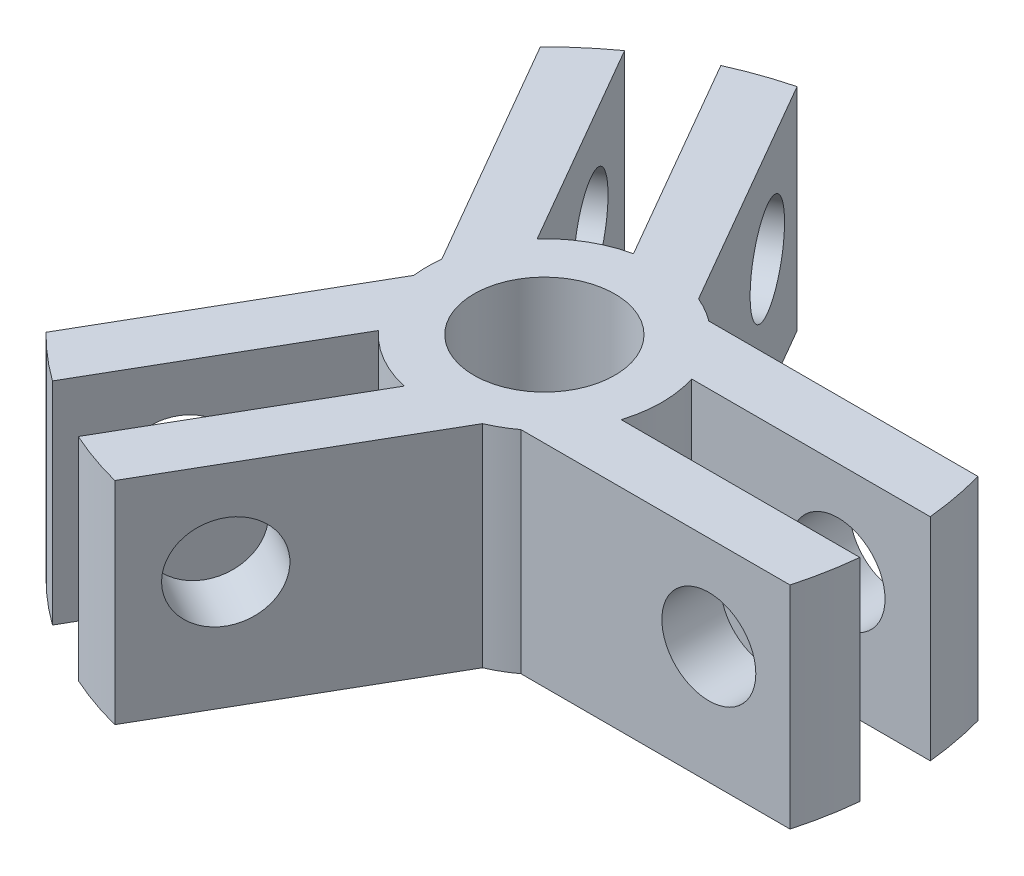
from build123d import *

# Parameters (mm, degrees)
SKETCH1_R          = 30
EXTRUDE1_DEPTH     = 18
M12_TAPPED_HOLE1_D = 12
CUT_EXTRUDE4_DEPTH = 47.086874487
CIRPATTERN11_COUNT = 3
CUT_EXTRUDE5_DEPTH = 47.086874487
CIRPATTERN12_COUNT = 3
SKETCH24_R         = 4
CUT_EXTRUDE6_DEPTH = 46.368708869
CIRPATTERN13_COUNT = 3


with BuildPart() as part:
    # Sketch1 → Extrude1 (new body)
    with BuildSketch(Plane(origin=(0, 0, 0), x_dir=(1, 0, 0), z_dir=(0, 1, 0))):
        with Locations(Location((0, 0, 0), (0, 0, 270))):
            Circle(SKETCH1_R)
    extrude(amount=EXTRUDE1_DEPTH)

    # M12 Tapped Hole1 (through all)
    with Locations(Plane(origin=(0, 18, 0), x_dir=(-1, 0, 0), z_dir=(0, 1, 0))):
        with Locations((0, 0)):
            Hole(M12_TAPPED_HOLE1_D / 2)

    # Sketch2 → Cut-Extrude4 (cut, through all)
    with BuildSketch(Plane(origin=(0, 18, 0), x_dir=(-1, 0, 0), z_dir=(0, 1, 0))):
        with BuildLine():
            Line((-29.849623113, -3), (-9.539392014, -3))
            ThreePointArc((-9.539392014, -3), (-10, 0), (-9.539392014, 3))
            Line((-9.539392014, 3), (-29.849623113, 3))
            ThreePointArc((-29.849623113, 3), (-30, 0), (-29.849623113, -3))
        make_face()
    cut_extrude4 = extrude(amount=-CUT_EXTRUDE4_DEPTH, mode=Mode.SUBTRACT)

    # CirPattern11: Cut-Extrude4 ×3 about axis
    cirpattern11_axis = Axis((0, 0, 0), (0, 1, 0))
    for i in range(1, CIRPATTERN11_COUNT):
        add(cut_extrude4.rotate(cirpattern11_axis, i * 360 / CIRPATTERN11_COUNT), mode=Mode.SUBTRACT)

    # Sketch23 → Cut-Extrude5 (cut, through all)
    with BuildSketch(Plane(origin=(0, 18, 0), x_dir=(-1, 0, 0), z_dir=(0, 1, 0))):
        with BuildLine():
            Line((-6, 8), (-28.91366459, 8))
            ThreePointArc((-28.91366459, 8), (-15, 25.980762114), (7.528629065, 29.039968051))
            Line((7.528629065, 29.039968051), (-3.92820323, 9.196152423))
            ThreePointArc((-3.92820323, 9.196152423), (-5, 8.660254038), (-6, 8))
        make_face()
    cut_extrude5 = extrude(amount=-CUT_EXTRUDE5_DEPTH, mode=Mode.SUBTRACT)

    # CirPattern12: Cut-Extrude5 ×3 about axis
    cirpattern12_axis = Axis((0, 0, 0), (0, 1, 0))
    for i in range(1, CIRPATTERN12_COUNT):
        add(cut_extrude5.rotate(cirpattern12_axis, i * 360 / CIRPATTERN12_COUNT), mode=Mode.SUBTRACT)

    # Sketch24 → Cut-Extrude6 (cut, symmetric)
    with BuildSketch(Plane.XY):
        with Locations((22, 10)):
            Circle(SKETCH24_R)
    cut_extrude6 = extrude(amount=CUT_EXTRUDE6_DEPTH, both=True, mode=Mode.SUBTRACT)

    # CirPattern13: Cut-Extrude6 ×3 about axis
    cirpattern13_axis = Axis((0, 18, 0), (0, -1, 0))
    for i in range(1, CIRPATTERN13_COUNT):
        add(cut_extrude6.rotate(cirpattern13_axis, i * 360 / CIRPATTERN13_COUNT), mode=Mode.SUBTRACT)


solid = part.part
